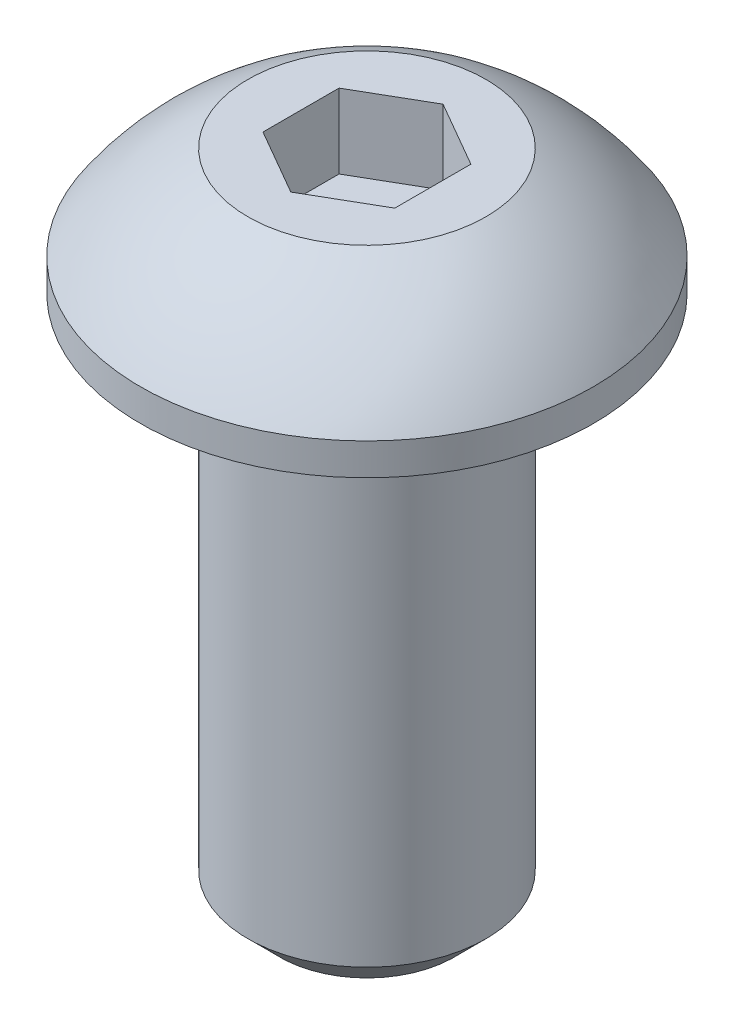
ISO-10303-21;
HEADER;
FILE_DESCRIPTION(('STEP AP214'),'2;1');
FILE_NAME('part.step','',(''),(''),'','','');
FILE_SCHEMA(('AUTOMOTIVE_DESIGN { 1 0 10303 214 1 1 1 1 }'));
ENDSEC;
DATA;
#1=APPLICATION_CONTEXT('core data for automotive mechanical design processes');
#2=APPLICATION_PROTOCOL_DEFINITION('international standard','automotive_design',2000,#1);
#3=PRODUCT_CONTEXT('',#1,'mechanical');
#4=PRODUCT('Part','Part','',(#3));
#5=PRODUCT_RELATED_PRODUCT_CATEGORY('part','',(#4));
#6=PRODUCT_DEFINITION_FORMATION('','',#4);
#7=PRODUCT_DEFINITION_CONTEXT('part definition',#1,'design');
#8=PRODUCT_DEFINITION('design','',#6,#7);
#9=PRODUCT_DEFINITION_SHAPE('','',#8);
#10=(LENGTH_UNIT() NAMED_UNIT(*) SI_UNIT(.MILLI.,.METRE.));
#11=(NAMED_UNIT(*) PLANE_ANGLE_UNIT() SI_UNIT($,.RADIAN.));
#12=(NAMED_UNIT(*) SI_UNIT($,.STERADIAN.) SOLID_ANGLE_UNIT());
#13=UNCERTAINTY_MEASURE_WITH_UNIT(LENGTH_MEASURE(1.E-05),#10,'distance_accuracy_value','');
#14=(GEOMETRIC_REPRESENTATION_CONTEXT(3) GLOBAL_UNCERTAINTY_ASSIGNED_CONTEXT((#13)) GLOBAL_UNIT_ASSIGNED_CONTEXT((#10,
#11,#12)) REPRESENTATION_CONTEXT('',''));
#15=CARTESIAN_POINT('',(0.,0.,0.));
#16=DIRECTION('',(0.,0.,1.));
#17=DIRECTION('',(1.,0.,0.));
#18=AXIS2_PLACEMENT_3D('',#15,#16,#17);
#19=CARTESIAN_POINT('',(-1.11022302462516E-13,0.,1.21430643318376E-13));
#20=DIRECTION('',(0.,-1.,0.));
#21=DIRECTION('',(0.,0.,-0.999999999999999));
#22=AXIS2_PLACEMENT_3D('',#19,#20,#21);
#23=PLANE('',#22);
#24=CARTESIAN_POINT('',(-1.11022302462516E-13,0.,1.21430643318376E-13));
#25=DIRECTION('',(0.,-1.,0.));
#26=DIRECTION('',(0.,0.,-0.999999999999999));
#27=AXIS2_PLACEMENT_3D('',#24,#25,#26);
#28=CIRCLE('',#27,1.4224);
#29=CARTESIAN_POINT('',(-1.12364606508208E-13,0.,-1.42239999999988));
#30=VERTEX_POINT('',#29);
#31=EDGE_CURVE('E11',#30,#30,#28,.T.);
#32=ORIENTED_EDGE('',*,*,#31,.F.);
#33=EDGE_LOOP('',(#32));
#34=FACE_BOUND('',#33,.T.);
#35=CARTESIAN_POINT('',(-1.11022302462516E-13,0.,1.21430643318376E-13));
#36=DIRECTION('',(0.,-1.,0.));
#37=DIRECTION('',(0.,0.,-0.999999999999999));
#38=AXIS2_PLACEMENT_3D('',#35,#36,#37);
#39=CIRCLE('',#38,2.7051);
#40=CARTESIAN_POINT('',(-1.13575077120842E-13,0.,-2.70509999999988));
#41=VERTEX_POINT('',#40);
#42=EDGE_CURVE('E33',#41,#41,#39,.T.);
#43=ORIENTED_EDGE('',*,*,#42,.T.);
#44=EDGE_LOOP('',(#43));
#45=FACE_BOUND('',#44,.T.);
#46=ADVANCED_FACE('F26',(#34,#45),#23,.T.);
#47=CARTESIAN_POINT('',(-1.11022302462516E-13,0.,1.21430643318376E-13));
#48=DIRECTION('',(0.,-1.,0.));
#49=DIRECTION('',(0.,0.,-0.999999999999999));
#50=AXIS2_PLACEMENT_3D('',#47,#48,#49);
#51=CYLINDRICAL_SURFACE('',#50,2.7051);
#52=CARTESIAN_POINT('',(0.,0.380999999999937,1.04083408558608E-13));
#53=DIRECTION('',(0.,-1.,0.));
#54=DIRECTION('',(0.,0.,-0.999999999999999));
#55=AXIS2_PLACEMENT_3D('',#52,#53,#54);
#56=CIRCLE('',#55,2.7051);
#57=CARTESIAN_POINT('',(2.70510000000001,0.380999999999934,1.19775569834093E-13));
#58=VERTEX_POINT('',#57);
#59=EDGE_CURVE('E143',#58,#58,#56,.T.);
#60=ORIENTED_EDGE('',*,*,#59,.T.);
#61=EDGE_LOOP('',(#60));
#62=FACE_BOUND('',#61,.T.);
#63=ORIENTED_EDGE('',*,*,#42,.F.);
#64=EDGE_LOOP('',(#63));
#65=FACE_BOUND('',#64,.T.);
#66=ADVANCED_FACE('F149',(#62,#65),#51,.T.);
#67=CARTESIAN_POINT('',(0.,-1.42882215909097,1.04083408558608E-13));
#68=DIRECTION('',(0.,-1.,0.));
#69=DIRECTION('',(1.,0.,0.));
#70=AXIS2_PLACEMENT_3D('',#67,#68,#69);
#71=SPHERICAL_SURFACE('',#70,3.25469234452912);
#72=CARTESIAN_POINT('',(0.,1.49859999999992,1.04083408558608E-13));
#73=DIRECTION('',(0.,-1.,0.));
#74=DIRECTION('',(0.,0.,-0.999999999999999));
#75=AXIS2_PLACEMENT_3D('',#72,#73,#74);
#76=CIRCLE('',#75,1.4224);
#77=CARTESIAN_POINT('',(1.42240000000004,1.49859999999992,1.26760889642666E-13));
#78=VERTEX_POINT('',#77);
#79=EDGE_CURVE('E140',#78,#78,#76,.T.);
#80=CARTESIAN_POINT('',(1.42240000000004,1.49859999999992,1.26760889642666E-13));
#81=CARTESIAN_POINT('',(1.43852697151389,1.49076411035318,1.26718446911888E-13));
#82=CARTESIAN_POINT('',(1.45458917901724,1.48279493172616,1.26674971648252E-13));
#83=CARTESIAN_POINT('',(1.4865797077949,1.46659223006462,1.26585968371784E-13));
#84=CARTESIAN_POINT('',(1.50250802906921,1.45835870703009,1.26540440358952E-13));
#85=CARTESIAN_POINT('',(1.53422642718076,1.44162955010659,1.26447343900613E-13));
#86=CARTESIAN_POINT('',(1.550016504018,1.43313391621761,1.26399775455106E-13));
#87=CARTESIAN_POINT('',(1.58145410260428,1.41588286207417,1.26302611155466E-13));
#88=CARTESIAN_POINT('',(1.59710162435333,1.4071274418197,1.26253015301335E-13));
#89=CARTESIAN_POINT('',(1.62824983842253,1.38935920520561,1.26151809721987E-13));
#90=CARTESIAN_POINT('',(1.64375053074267,1.38034638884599,1.2610019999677E-13));
#91=CARTESIAN_POINT('',(1.67460085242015,1.36206582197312,1.25994980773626E-13));
#92=CARTESIAN_POINT('',(1.68995048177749,1.35279807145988,1.25941371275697E-13));
#93=CARTESIAN_POINT('',(1.72049448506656,1.33401016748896,1.25832167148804E-13));
#94=CARTESIAN_POINT('',(1.7356888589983,1.32449001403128,1.2577657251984E-13));
#95=CARTESIAN_POINT('',(1.7659182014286,1.30519990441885,1.25663413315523E-13));
#96=CARTESIAN_POINT('',(1.78095316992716,1.2954299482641,1.25605848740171E-13));
#97=CARTESIAN_POINT('',(1.81085959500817,1.27564290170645,1.25488765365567E-13));
#98=CARTESIAN_POINT('',(1.82573105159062,1.26562581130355,1.25429246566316E-13));
#99=CARTESIAN_POINT('',(1.85530639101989,1.24534723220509,1.25308271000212E-13));
#100=CARTESIAN_POINT('',(1.87001027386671,1.23508574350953,1.2524681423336E-13));
#101=CARTESIAN_POINT('',(1.89924644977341,1.21432117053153,1.25121979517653E-13));
#102=CARTESIAN_POINT('',(1.9137787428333,1.20381808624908,1.25058601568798E-13));
#103=CARTESIAN_POINT('',(1.94266776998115,1.18257319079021,1.24929941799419E-13));
#104=CARTESIAN_POINT('',(1.95702450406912,1.1718313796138,1.24864659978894E-13));
#105=CARTESIAN_POINT('',(1.98555849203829,1.15011196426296,1.24732210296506E-13));
#106=CARTESIAN_POINT('',(1.99973574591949,1.13913436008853,1.24665042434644E-13));
#107=CARTESIAN_POINT('',(2.02790690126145,1.11694635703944,1.24528839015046E-13));
#108=CARTESIAN_POINT('',(2.04190080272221,1.10573595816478,1.24459803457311E-13));
#109=CARTESIAN_POINT('',(2.06970143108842,1.08308542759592,1.24319883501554E-13));
#110=CARTESIAN_POINT('',(2.08350815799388,1.07164529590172,1.24248999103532E-13));
#111=CARTESIAN_POINT('',(2.11093066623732,1.04853842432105,1.24105400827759E-13));
#112=CARTESIAN_POINT('',(2.1245464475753,1.03687168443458,1.24032686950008E-13));
#113=CARTESIAN_POINT('',(2.15158334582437,1.01331478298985,1.23885449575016E-13));
#114=CARTESIAN_POINT('',(2.16500446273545,1.00142462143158,1.23810926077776E-13));
#115=CARTESIAN_POINT('',(2.19164836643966,0.977424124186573,1.23660089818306E-13));
#116=CARTESIAN_POINT('',(2.2048711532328,0.965313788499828,1.23583777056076E-13));
#117=CARTESIAN_POINT('',(2.23111478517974,0.94087625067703,1.23429383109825E-13));
#118=CARTESIAN_POINT('',(2.24413563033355,0.928549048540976,1.23351301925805E-13));
#119=CARTESIAN_POINT('',(2.26997182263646,0.903681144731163,1.23193392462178E-13));
#120=CARTESIAN_POINT('',(2.28278716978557,0.891140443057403,1.23113564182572E-13));
#121=CARTESIAN_POINT('',(2.30820886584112,0.865848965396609,1.22952182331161E-13));
#122=CARTESIAN_POINT('',(2.32081521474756,0.853098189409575,1.22870628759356E-13));
#123=CARTESIAN_POINT('',(2.34581547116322,0.827390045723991,1.22705818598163E-13));
#124=CARTESIAN_POINT('',(2.35820937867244,0.814432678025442,1.22622562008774E-13));
#125=CARTESIAN_POINT('',(2.38278136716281,0.788314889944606,1.22454368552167E-13));
#126=CARTESIAN_POINT('',(2.39495944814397,0.775154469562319,1.2236943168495E-13));
#127=CARTESIAN_POINT('',(2.41909645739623,0.748634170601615,1.22197900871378E-13));
#128=CARTESIAN_POINT('',(2.43105538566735,0.735274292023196,1.22111306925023E-13));
#129=CARTESIAN_POINT('',(2.45475082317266,0.708358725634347,1.21936485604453E-13));
#130=CARTESIAN_POINT('',(2.46648733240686,0.694803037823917,1.21848258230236E-13));
#131=CARTESIAN_POINT('',(2.48973472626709,0.667499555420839,1.21670194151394E-13));
#132=CARTESIAN_POINT('',(2.50124561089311,0.653751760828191,1.21580357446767E-13));
#133=CARTESIAN_POINT('',(2.52403861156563,0.62606781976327,1.21399099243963E-13));
#134=CARTESIAN_POINT('',(2.53532072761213,0.612131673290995,1.21307677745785E-13));
#135=CARTESIAN_POINT('',(2.55765310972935,0.584074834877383,1.21123274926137E-13));
#136=CARTESIAN_POINT('',(2.56870337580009,0.569954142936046,1.21030293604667E-13));
#137=CARTESIAN_POINT('',(2.59056903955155,0.541532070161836,1.20842796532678E-13));
#138=CARTESIAN_POINT('',(2.60138443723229,0.527230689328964,1.20748280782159E-13));
#139=CARTESIAN_POINT('',(2.62277741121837,0.498451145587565,1.2055774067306E-13));
#140=CARTESIAN_POINT('',(2.63335498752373,0.483972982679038,1.2046171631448E-13));
#141=CARTESIAN_POINT('',(2.65426942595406,0.454843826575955,1.20268185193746E-13));
#142=CARTESIAN_POINT('',(2.66460628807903,0.440192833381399,1.20170678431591E-13));
#143=CARTESIAN_POINT('',(2.6850364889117,0.410722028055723,1.19974209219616E-13));
#144=CARTESIAN_POINT('',(2.6951298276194,0.395902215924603,1.19875246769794E-13));
#145=CARTESIAN_POINT('',(2.70510000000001,0.380999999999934,1.19775569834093E-13));
#146=B_SPLINE_CURVE_WITH_KNOTS('',3,(#80,#81,#82,#83,#84,#85,#86,#87,#88,#89,#90,#91,#92,#93,
#94,#95,#96,#97,#98,#99,#100,#101,#102,#103,#104,#105,#106,#107,#108,#109,#110,#111,#112,#113,
#114,#115,#116,#117,#118,#119,#120,#121,#122,#123,#124,#125,#126,#127,#128,#129,#130,#131,#132,
#133,#134,#135,#136,#137,#138,#139,#140,#141,#142,#143,#144,#145),.UNSPECIFIED.,.F.,.F.,(4,2,2,
2,2,2,2,2,2,2,2,2,2,2,2,2,2,2,2,2,2,2,2,2,2,2,2,2,2,2,2,2,4),(0.,0.0537890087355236,
0.107578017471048,0.161367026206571,0.215156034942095,0.268945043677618,0.322734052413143,
0.376523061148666,0.430312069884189,0.484101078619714,0.537890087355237,0.59167909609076,
0.645468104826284,0.699257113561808,0.753046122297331,0.806835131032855,0.860624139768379,
0.914413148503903,0.968202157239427,1.02199116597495,1.07578017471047,1.129569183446,
1.18335819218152,1.23714720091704,1.29093620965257,1.34472521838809,1.39851422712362,
1.45230323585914,1.50609224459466,1.55988125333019,1.61367026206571,1.66745927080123,
1.72124827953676),.UNSPECIFIED.);
#147=EDGE_CURVE('BSEAM151',#78,#58,#146,.T.);
#148=ORIENTED_EDGE('',*,*,#79,.T.);
#149=ORIENTED_EDGE('',*,*,#59,.F.);
#150=ORIENTED_EDGE('',*,*,#147,.T.);
#151=ORIENTED_EDGE('',*,*,#147,.F.);
#152=EDGE_LOOP('',(#148,#150,#149,#151));
#153=FACE_BOUND('',#152,.T.);
#154=ADVANCED_FACE('F151',(#153),#71,.T.);
#155=CARTESIAN_POINT('',(1.42240000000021,1.49859999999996,0.));
#156=DIRECTION('',(0.,1.,0.));
#157=DIRECTION('',(0.,0.,0.999999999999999));
#158=AXIS2_PLACEMENT_3D('',#155,#156,#157);
#159=PLANE('',#158);
#160=DIRECTION('',(1.0207515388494E-11,0.,1.));
#161=VECTOR('',#160,1.);
#162=CARTESIAN_POINT('',(-0.787400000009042,1.49859999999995,-0.454605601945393));
#163=LINE('',#162,#161);
#164=CARTESIAN_POINT('',(-0.787400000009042,1.49859999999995,-0.454605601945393));
#165=VERTEX_POINT('',#164);
#166=CARTESIAN_POINT('',(-0.787399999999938,1.49859999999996,0.454605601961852));
#167=VERTEX_POINT('',#166);
#168=EDGE_CURVE('E40',#165,#167,#163,.T.);
#169=ORIENTED_EDGE('',*,*,#168,.F.);
#170=DIRECTION('',(-0.866025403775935,0.,0.500000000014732));
#171=VECTOR('',#170,1.);
#172=CARTESIAN_POINT('',(-1.38777878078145E-11,1.49859999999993,-0.909211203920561));
#173=LINE('',#172,#171);
#174=CARTESIAN_POINT('',(-1.38777878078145E-11,1.49859999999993,-0.909211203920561));
#175=VERTEX_POINT('',#174);
#176=EDGE_CURVE('E110',#175,#165,#173,.T.);
#177=ORIENTED_EDGE('',*,*,#176,.F.);
#178=DIRECTION('',(-0.866025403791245,0.,-0.499999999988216));
#179=VECTOR('',#178,1.);
#180=CARTESIAN_POINT('',(0.787399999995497,1.49859999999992,-0.454605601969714));
#181=LINE('',#180,#179);
#182=CARTESIAN_POINT('',(0.787399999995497,1.49859999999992,-0.454605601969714));
#183=VERTEX_POINT('',#182);
#184=EDGE_CURVE('E104',#183,#175,#181,.T.);
#185=ORIENTED_EDGE('',*,*,#184,.F.);
#186=DIRECTION('',(-1.0207515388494E-11,0.,-1.));
#187=VECTOR('',#186,1.);
#188=CARTESIAN_POINT('',(0.787400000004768,1.49859999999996,0.454605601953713));
#189=LINE('',#188,#187);
#190=CARTESIAN_POINT('',(0.787400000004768,1.49859999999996,0.454605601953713));
#191=VERTEX_POINT('',#190);
#192=EDGE_CURVE('E102',#191,#183,#189,.T.);
#193=ORIENTED_EDGE('',*,*,#192,.F.);
#194=DIRECTION('',(0.866025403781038,0.,-0.500000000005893));
#195=VECTOR('',#194,1.);
#196=CARTESIAN_POINT('',(4.32986979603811E-12,1.49859999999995,0.90921120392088));
#197=LINE('',#196,#195);
#198=CARTESIAN_POINT('',(4.32986979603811E-12,1.49859999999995,0.90921120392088));
#199=VERTEX_POINT('',#198);
#200=EDGE_CURVE('E83',#199,#191,#197,.T.);
#201=ORIENTED_EDGE('',*,*,#200,.F.);
#202=DIRECTION('',(0.866025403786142,0.,0.499999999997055));
#203=VECTOR('',#202,1.);
#204=CARTESIAN_POINT('',(-0.787399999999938,1.49859999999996,0.454605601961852));
#205=LINE('',#204,#203);
#206=EDGE_CURVE('E94',#167,#199,#205,.T.);
#207=ORIENTED_EDGE('',*,*,#206,.F.);
#208=EDGE_LOOP('',(#169,#177,#185,#193,#201,#207));
#209=FACE_BOUND('',#208,.T.);
#210=ORIENTED_EDGE('',*,*,#79,.F.);
#211=EDGE_LOOP('',(#210));
#212=FACE_BOUND('',#211,.T.);
#213=ADVANCED_FACE('F98',(#209,#212),#159,.T.);
#214=CARTESIAN_POINT('',(1.11022302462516E-13,-6.35000000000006,0.));
#215=DIRECTION('',(0.,-1.,0.));
#216=DIRECTION('',(0.,0.,-0.999999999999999));
#217=AXIS2_PLACEMENT_3D('',#214,#215,#216);
#218=PLANE('',#217);
#219=CARTESIAN_POINT('',(1.11022302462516E-13,-6.35000000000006,0.));
#220=DIRECTION('',(0.,-1.,0.));
#221=DIRECTION('',(0.,0.,-0.999999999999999));
#222=AXIS2_PLACEMENT_3D('',#219,#220,#221);
#223=CIRCLE('',#222,1.04394);
#224=CARTESIAN_POINT('',(1.10037147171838E-13,-6.35000000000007,-1.04393999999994));
#225=VERTEX_POINT('',#224);
#226=EDGE_CURVE('E137',#225,#225,#223,.T.);
#227=ORIENTED_EDGE('',*,*,#226,.T.);
#228=EDGE_LOOP('',(#227));
#229=FACE_BOUND('',#228,.T.);
#230=ADVANCED_FACE('F163',(#229),#218,.T.);
#231=CARTESIAN_POINT('',(1.11022302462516E-13,-6.35000000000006,0.));
#232=DIRECTION('',(0.,1.,0.));
#233=DIRECTION('',(0.,0.,0.999999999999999));
#234=AXIS2_PLACEMENT_3D('',#231,#232,#233);
#235=CONICAL_SURFACE('',#234,1.04394,0.785398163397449);
#236=CARTESIAN_POINT('',(1.66533453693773E-13,-5.97154000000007,0.));
#237=DIRECTION('',(0.,-1.,0.));
#238=DIRECTION('',(0.,0.,-0.999999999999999));
#239=AXIS2_PLACEMENT_3D('',#236,#237,#238);
#240=CIRCLE('',#239,1.4224);
#241=CARTESIAN_POINT('',(1.65191149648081E-13,-5.97154000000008,-1.42239999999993));
#242=VERTEX_POINT('',#241);
#243=EDGE_CURVE('E128',#242,#242,#240,.T.);
#244=ORIENTED_EDGE('',*,*,#243,.T.);
#245=EDGE_LOOP('',(#244));
#246=FACE_BOUND('',#245,.T.);
#247=ORIENTED_EDGE('',*,*,#226,.F.);
#248=EDGE_LOOP('',(#247));
#249=FACE_BOUND('',#248,.T.);
#250=ADVANCED_FACE('F166',(#246,#249),#235,.T.);
#251=CARTESIAN_POINT('',(-1.11022302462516E-13,0.,1.21430643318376E-13));
#252=DIRECTION('',(0.,-1.,0.));
#253=DIRECTION('',(0.,0.,-0.999999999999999));
#254=AXIS2_PLACEMENT_3D('',#251,#252,#253);
#255=CYLINDRICAL_SURFACE('',#254,1.4224);
#256=ORIENTED_EDGE('',*,*,#31,.T.);
#257=EDGE_LOOP('',(#256));
#258=FACE_BOUND('',#257,.T.);
#259=ORIENTED_EDGE('',*,*,#243,.F.);
#260=EDGE_LOOP('',(#259));
#261=FACE_BOUND('',#260,.T.);
#262=ADVANCED_FACE('F170',(#258,#261),#255,.T.);
#263=CARTESIAN_POINT('',(-0.787400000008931,0.609599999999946,-0.454605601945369));
#264=DIRECTION('',(-1.,0.,1.0205489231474E-11));
#265=DIRECTION('',(1.0207515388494E-11,0.,1.));
#266=AXIS2_PLACEMENT_3D('',#263,#264,#265);
#267=PLANE('',#266);
#268=ORIENTED_EDGE('',*,*,#168,.T.);
#269=DIRECTION('',(0.,1.,0.));
#270=VECTOR('',#269,1.);
#271=CARTESIAN_POINT('',(-0.787399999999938,0.609599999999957,0.454605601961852));
#272=LINE('',#271,#270);
#273=CARTESIAN_POINT('',(-0.787399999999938,0.609599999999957,0.454605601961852));
#274=VERTEX_POINT('',#273);
#275=EDGE_CURVE('E91',#274,#167,#272,.T.);
#276=ORIENTED_EDGE('',*,*,#275,.F.);
#277=DIRECTION('',(1.0207515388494E-11,0.,1.));
#278=VECTOR('',#277,1.);
#279=CARTESIAN_POINT('',(-0.787400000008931,0.609599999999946,-0.454605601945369));
#280=LINE('',#279,#278);
#281=CARTESIAN_POINT('',(-0.787400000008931,0.609599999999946,-0.454605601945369));
#282=VERTEX_POINT('',#281);
#283=EDGE_CURVE('E112',#282,#274,#280,.T.);
#284=ORIENTED_EDGE('',*,*,#283,.F.);
#285=DIRECTION('',(0.,1.,0.));
#286=VECTOR('',#285,1.);
#287=CARTESIAN_POINT('',(-0.787400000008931,0.609599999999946,-0.454605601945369));
#288=LINE('',#287,#286);
#289=EDGE_CURVE('E47',#282,#165,#288,.T.);
#290=ORIENTED_EDGE('',*,*,#289,.T.);
#291=EDGE_LOOP('',(#268,#276,#284,#290));
#292=FACE_BOUND('',#291,.T.);
#293=ADVANCED_FACE('F174',(#292),#267,.F.);
#294=CARTESIAN_POINT('',(-1.39332989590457E-11,0.609599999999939,-0.909211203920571));
#295=DIRECTION('',(-0.500000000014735,0.,-0.866025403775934));
#296=DIRECTION('',(-0.866025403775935,0.,0.500000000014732));
#297=AXIS2_PLACEMENT_3D('',#294,#295,#296);
#298=PLANE('',#297);
#299=ORIENTED_EDGE('',*,*,#176,.T.);
#300=ORIENTED_EDGE('',*,*,#289,.F.);
#301=DIRECTION('',(-0.866025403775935,0.,0.500000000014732));
#302=VECTOR('',#301,1.);
#303=CARTESIAN_POINT('',(-1.39332989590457E-11,0.609599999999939,-0.909211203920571));
#304=LINE('',#303,#302);
#305=CARTESIAN_POINT('',(-1.39332989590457E-11,0.609599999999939,-0.909211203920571));
#306=VERTEX_POINT('',#305);
#307=EDGE_CURVE('E124',#306,#282,#304,.T.);
#308=ORIENTED_EDGE('',*,*,#307,.F.);
#309=DIRECTION('',(0.,1.,0.));
#310=VECTOR('',#309,1.);
#311=CARTESIAN_POINT('',(-1.39332989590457E-11,0.609599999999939,-0.909211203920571));
#312=LINE('',#311,#310);
#313=EDGE_CURVE('E129',#306,#175,#312,.T.);
#314=ORIENTED_EDGE('',*,*,#313,.T.);
#315=EDGE_LOOP('',(#299,#300,#308,#314));
#316=FACE_BOUND('',#315,.T.);
#317=ADVANCED_FACE('F178',(#316),#298,.F.);
#318=CARTESIAN_POINT('',(0.787399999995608,0.609599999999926,-0.45460560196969));
#319=DIRECTION('',(0.499999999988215,0.,-0.866025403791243));
#320=DIRECTION('',(-0.866025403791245,0.,-0.499999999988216));
#321=AXIS2_PLACEMENT_3D('',#318,#319,#320);
#322=PLANE('',#321);
#323=ORIENTED_EDGE('',*,*,#184,.T.);
#324=ORIENTED_EDGE('',*,*,#313,.F.);
#325=DIRECTION('',(-0.866025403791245,0.,-0.499999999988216));
#326=VECTOR('',#325,1.);
#327=CARTESIAN_POINT('',(0.787399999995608,0.609599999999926,-0.45460560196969));
#328=LINE('',#327,#326);
#329=CARTESIAN_POINT('',(0.787399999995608,0.609599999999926,-0.45460560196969));
#330=VERTEX_POINT('',#329);
#331=EDGE_CURVE('E121',#330,#306,#328,.T.);
#332=ORIENTED_EDGE('',*,*,#331,.F.);
#333=DIRECTION('',(0.,1.,0.));
#334=VECTOR('',#333,1.);
#335=CARTESIAN_POINT('',(0.787399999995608,0.609599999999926,-0.45460560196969));
#336=LINE('',#335,#334);
#337=EDGE_CURVE('E131',#330,#183,#336,.T.);
#338=ORIENTED_EDGE('',*,*,#337,.T.);
#339=EDGE_LOOP('',(#323,#324,#332,#338));
#340=FACE_BOUND('',#339,.T.);
#341=ADVANCED_FACE('F187',(#340),#322,.F.);
#342=CARTESIAN_POINT('',(0.787400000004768,0.609599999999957,0.454605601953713));
#343=DIRECTION('',(1.,0.,-1.0205489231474E-11));
#344=DIRECTION('',(-1.0207515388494E-11,0.,-1.));
#345=AXIS2_PLACEMENT_3D('',#342,#343,#344);
#346=PLANE('',#345);
#347=ORIENTED_EDGE('',*,*,#192,.T.);
#348=ORIENTED_EDGE('',*,*,#337,.F.);
#349=DIRECTION('',(-1.0207515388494E-11,0.,-1.));
#350=VECTOR('',#349,1.);
#351=CARTESIAN_POINT('',(0.787400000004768,0.609599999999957,0.454605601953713));
#352=LINE('',#351,#350);
#353=CARTESIAN_POINT('',(0.787400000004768,0.609599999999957,0.454605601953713));
#354=VERTEX_POINT('',#353);
#355=EDGE_CURVE('E118',#354,#330,#352,.T.);
#356=ORIENTED_EDGE('',*,*,#355,.F.);
#357=DIRECTION('',(0.,1.,0.));
#358=VECTOR('',#357,1.);
#359=CARTESIAN_POINT('',(0.787400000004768,0.609599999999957,0.454605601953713));
#360=LINE('',#359,#358);
#361=EDGE_CURVE('E90',#354,#191,#360,.T.);
#362=ORIENTED_EDGE('',*,*,#361,.T.);
#363=EDGE_LOOP('',(#347,#348,#356,#362));
#364=FACE_BOUND('',#363,.T.);
#365=ADVANCED_FACE('F184',(#364),#346,.F.);
#366=CARTESIAN_POINT('',(4.55191440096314E-12,0.60959999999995,0.909211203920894));
#367=DIRECTION('',(0.500000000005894,0.,0.866025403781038));
#368=DIRECTION('',(0.866025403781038,0.,-0.500000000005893));
#369=AXIS2_PLACEMENT_3D('',#366,#367,#368);
#370=PLANE('',#369);
#371=ORIENTED_EDGE('',*,*,#200,.T.);
#372=ORIENTED_EDGE('',*,*,#361,.F.);
#373=DIRECTION('',(0.866025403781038,0.,-0.500000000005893));
#374=VECTOR('',#373,1.);
#375=CARTESIAN_POINT('',(4.55191440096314E-12,0.60959999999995,0.909211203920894));
#376=LINE('',#375,#374);
#377=CARTESIAN_POINT('',(4.55191440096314E-12,0.60959999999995,0.909211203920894));
#378=VERTEX_POINT('',#377);
#379=EDGE_CURVE('E86',#378,#354,#376,.T.);
#380=ORIENTED_EDGE('',*,*,#379,.F.);
#381=DIRECTION('',(0.,1.,0.));
#382=VECTOR('',#381,1.);
#383=CARTESIAN_POINT('',(4.55191440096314E-12,0.60959999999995,0.909211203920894));
#384=LINE('',#383,#382);
#385=EDGE_CURVE('E79',#378,#199,#384,.T.);
#386=ORIENTED_EDGE('',*,*,#385,.T.);
#387=EDGE_LOOP('',(#371,#372,#380,#386));
#388=FACE_BOUND('',#387,.T.);
#389=ADVANCED_FACE('F81',(#388),#370,.F.);
#390=CARTESIAN_POINT('',(-0.787399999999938,0.609599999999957,0.454605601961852));
#391=DIRECTION('',(-0.499999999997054,0.,0.86602540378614));
#392=DIRECTION('',(0.866025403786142,0.,0.499999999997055));
#393=AXIS2_PLACEMENT_3D('',#390,#391,#392);
#394=PLANE('',#393);
#395=ORIENTED_EDGE('',*,*,#206,.T.);
#396=ORIENTED_EDGE('',*,*,#385,.F.);
#397=DIRECTION('',(0.866025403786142,0.,0.499999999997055));
#398=VECTOR('',#397,1.);
#399=CARTESIAN_POINT('',(-0.787399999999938,0.609599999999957,0.454605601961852));
#400=LINE('',#399,#398);
#401=EDGE_CURVE('E115',#274,#378,#400,.T.);
#402=ORIENTED_EDGE('',*,*,#401,.F.);
#403=ORIENTED_EDGE('',*,*,#275,.T.);
#404=EDGE_LOOP('',(#395,#396,#402,#403));
#405=FACE_BOUND('',#404,.T.);
#406=ADVANCED_FACE('F95',(#405),#394,.F.);
#407=CARTESIAN_POINT('',(-0.787399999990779,0.609599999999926,1.36381680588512));
#408=DIRECTION('',(0.,1.,0.));
#409=DIRECTION('',(0.,0.,0.999999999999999));
#410=AXIS2_PLACEMENT_3D('',#407,#408,#409);
#411=PLANE('',#410);
#412=ORIENTED_EDGE('',*,*,#283,.T.);
#413=ORIENTED_EDGE('',*,*,#401,.T.);
#414=ORIENTED_EDGE('',*,*,#379,.T.);
#415=ORIENTED_EDGE('',*,*,#355,.T.);
#416=ORIENTED_EDGE('',*,*,#331,.T.);
#417=ORIENTED_EDGE('',*,*,#307,.T.);
#418=EDGE_LOOP('',(#412,#413,#414,#415,#416,#417));
#419=FACE_BOUND('',#418,.T.);
#420=ADVANCED_FACE('F181',(#419),#411,.T.);
#421=CLOSED_SHELL('',(#46,#66,#154,#213,#230,#250,#262,#293,#317,#341,#365,#389,#406,#420));
#422=MANIFOLD_SOLID_BREP('B2',#421);
#423=ADVANCED_BREP_SHAPE_REPRESENTATION('',(#18,#422),#14);
#424=SHAPE_DEFINITION_REPRESENTATION(#9,#423);
ENDSEC;
END-ISO-10303-21;
